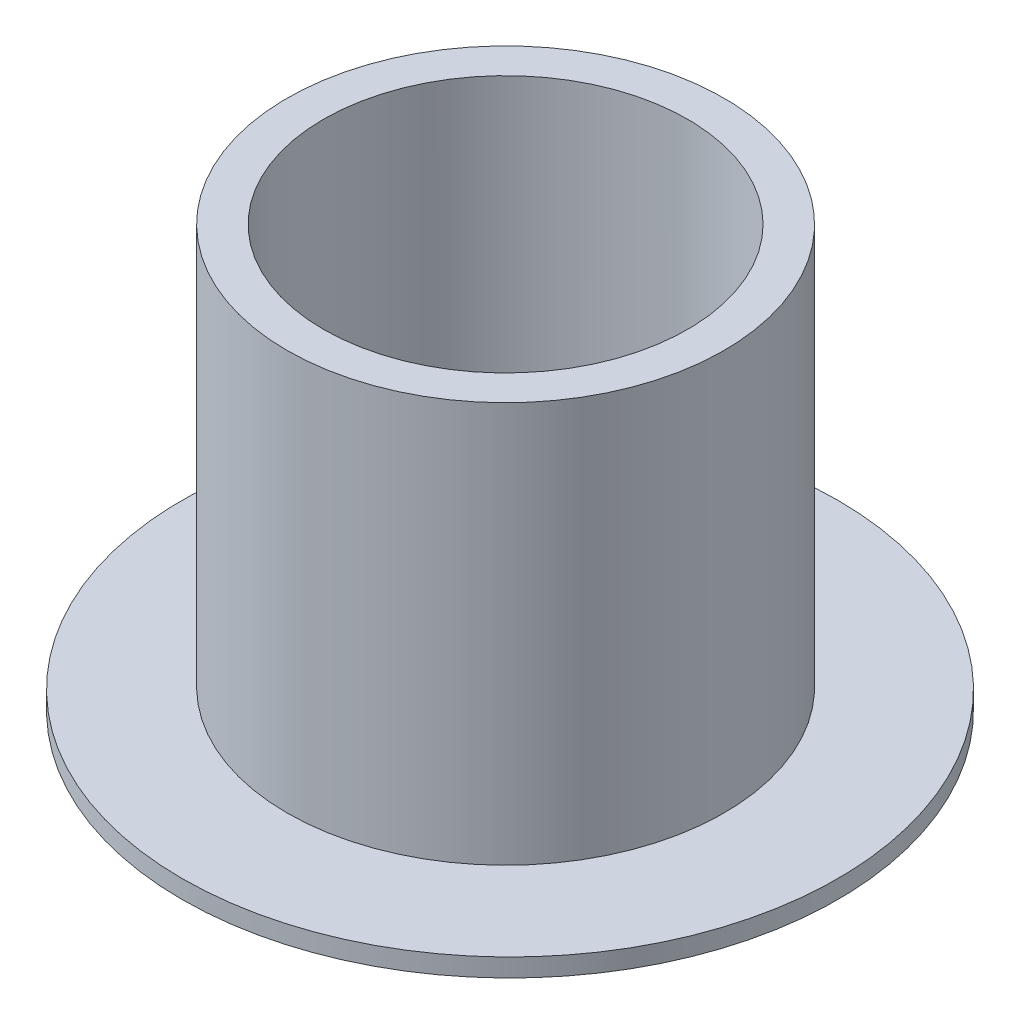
from build123d import *

# Parameters (mm, degrees)
SKETCH1_R           = 15.24
SKETCH1_R_2         = 12.7
BOSS_EXTRUDE1_DEPTH = 27.94
SKETCH2_R           = 22.86
SKETCH2_R_2         = 13.007730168
BOSS_EXTRUDE2_DEPTH = 1.27


with BuildPart() as part:
    # Sketch1 → Boss-Extrude1 (new body)
    with BuildSketch(Plane(origin=(0, 0, 0), x_dir=(1, 0, 0), z_dir=(0, 1, 0))):
        with Locations(Location((0, 0, 0), (0, 0, 270))):
            Circle(SKETCH1_R)
        with Locations(Location((0, 0, 0), (0, 0, 270))):
            Circle(SKETCH1_R_2, mode=Mode.SUBTRACT)
    extrude(amount=BOSS_EXTRUDE1_DEPTH)

    # Sketch2 → Boss-Extrude2 (add)
    with BuildSketch(Plane.XZ):
        with Locations(Location((0.307730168, 0, 0), (0, 0, 270))):
            Circle(SKETCH2_R)
        with Locations(Location((0.307730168, 0, 0), (0, 0, 180))):
            Circle(SKETCH2_R_2, mode=Mode.SUBTRACT)
    extrude(amount=BOSS_EXTRUDE2_DEPTH)


solid = part.part
